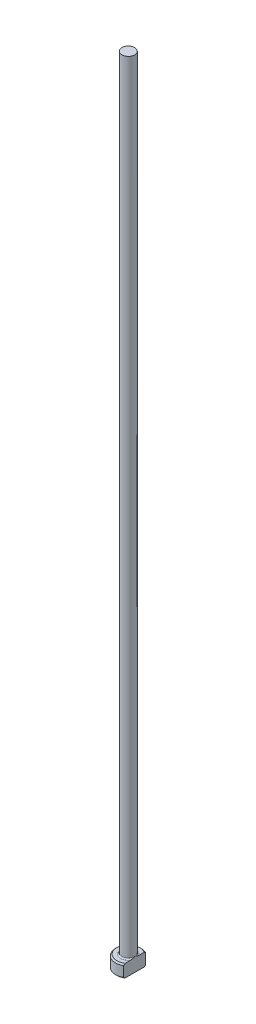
ISO-10303-21;
HEADER;
FILE_DESCRIPTION(('STEP AP214'),'2;1');
FILE_NAME('part.step','',(''),(''),'','','');
FILE_SCHEMA(('AUTOMOTIVE_DESIGN { 1 0 10303 214 1 1 1 1 }'));
ENDSEC;
DATA;
#1=APPLICATION_CONTEXT('core data for automotive mechanical design processes');
#2=APPLICATION_PROTOCOL_DEFINITION('international standard','automotive_design',2000,#1);
#3=PRODUCT_CONTEXT('',#1,'mechanical');
#4=PRODUCT('Part','Part','',(#3));
#5=PRODUCT_RELATED_PRODUCT_CATEGORY('part','',(#4));
#6=PRODUCT_DEFINITION_FORMATION('','',#4);
#7=PRODUCT_DEFINITION_CONTEXT('part definition',#1,'design');
#8=PRODUCT_DEFINITION('design','',#6,#7);
#9=PRODUCT_DEFINITION_SHAPE('','',#8);
#10=(LENGTH_UNIT() NAMED_UNIT(*) SI_UNIT(.MILLI.,.METRE.));
#11=(NAMED_UNIT(*) PLANE_ANGLE_UNIT() SI_UNIT($,.RADIAN.));
#12=(NAMED_UNIT(*) SI_UNIT($,.STERADIAN.) SOLID_ANGLE_UNIT());
#13=UNCERTAINTY_MEASURE_WITH_UNIT(LENGTH_MEASURE(1.E-05),#10,'distance_accuracy_value','');
#14=(GEOMETRIC_REPRESENTATION_CONTEXT(3) GLOBAL_UNCERTAINTY_ASSIGNED_CONTEXT((#13)) GLOBAL_UNIT_ASSIGNED_CONTEXT((#10,
#11,#12)) REPRESENTATION_CONTEXT('',''));
#15=CARTESIAN_POINT('',(0.,0.,0.));
#16=DIRECTION('',(0.,0.,1.));
#17=DIRECTION('',(1.,0.,0.));
#18=AXIS2_PLACEMENT_3D('',#15,#16,#17);
#19=CARTESIAN_POINT('',(0.,0.,0.));
#20=DIRECTION('',(0.,-1.,0.));
#21=DIRECTION('',(0.,0.,-1.));
#22=AXIS2_PLACEMENT_3D('',#19,#20,#21);
#23=PLANE('',#22);
#24=CARTESIAN_POINT('',(0.,0.,0.));
#25=DIRECTION('',(0.,-1.,0.));
#26=DIRECTION('',(0.,0.,-1.));
#27=AXIS2_PLACEMENT_3D('',#24,#25,#26);
#28=CIRCLE('',#27,1.8);
#29=CARTESIAN_POINT('',(0.999999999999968,0.,1.49666295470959));
#30=VERTEX_POINT('',#29);
#31=CARTESIAN_POINT('',(0.999999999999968,0.,-1.49666295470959));
#32=VERTEX_POINT('',#31);
#33=EDGE_CURVE('E98',#30,#32,#28,.T.);
#34=ORIENTED_EDGE('',*,*,#33,.T.);
#35=DIRECTION('',(0.,0.,1.));
#36=VECTOR('',#35,1.);
#37=CARTESIAN_POINT('',(0.999999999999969,0.,-1.73205080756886));
#38=LINE('',#37,#36);
#39=EDGE_CURVE('E83',#32,#30,#38,.T.);
#40=ORIENTED_EDGE('',*,*,#39,.T.);
#41=EDGE_LOOP('',(#34,#40));
#42=FACE_BOUND('',#41,.T.);
#43=ADVANCED_FACE('F32',(#42),#23,.T.);
#44=CARTESIAN_POINT('',(0.,259.958771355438,0.));
#45=DIRECTION('',(0.,1.,0.));
#46=DIRECTION('',(0.,0.,1.));
#47=AXIS2_PLACEMENT_3D('',#44,#45,#46);
#48=CYLINDRICAL_SURFACE('',#47,1.99999999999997);
#49=CARTESIAN_POINT('',(0.,1.79999999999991,0.));
#50=DIRECTION('',(0.,1.,0.));
#51=DIRECTION('',(0.,0.,1.));
#52=AXIS2_PLACEMENT_3D('',#49,#50,#51);
#53=CIRCLE('',#52,1.99999999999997);
#54=CARTESIAN_POINT('',(0.999999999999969,1.79999999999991,1.73205080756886));
#55=VERTEX_POINT('',#54);
#56=CARTESIAN_POINT('',(0.999999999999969,1.79999999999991,-1.73205080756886));
#57=VERTEX_POINT('',#56);
#58=EDGE_CURVE('E104',#55,#57,#53,.F.);
#59=ORIENTED_EDGE('',*,*,#58,.T.);
#60=DIRECTION('',(0.,-1.,0.));
#61=VECTOR('',#60,1.);
#62=CARTESIAN_POINT('',(0.999999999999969,125.,-1.73205080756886));
#63=LINE('',#62,#61);
#64=CARTESIAN_POINT('',(0.999999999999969,0.199999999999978,-1.73205080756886));
#65=VERTEX_POINT('',#64);
#66=EDGE_CURVE('E183',#57,#65,#63,.T.);
#67=ORIENTED_EDGE('',*,*,#66,.T.);
#68=CARTESIAN_POINT('',(0.,0.199999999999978,0.));
#69=DIRECTION('',(0.,-1.,0.));
#70=DIRECTION('',(0.,0.,-1.));
#71=AXIS2_PLACEMENT_3D('',#68,#69,#70);
#72=CIRCLE('',#71,1.99999999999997);
#73=CARTESIAN_POINT('',(0.999999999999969,0.199999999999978,1.73205080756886));
#74=VERTEX_POINT('',#73);
#75=EDGE_CURVE('E100',#65,#74,#72,.F.);
#76=ORIENTED_EDGE('',*,*,#75,.T.);
#77=DIRECTION('',(0.,-1.,0.));
#78=VECTOR('',#77,1.);
#79=CARTESIAN_POINT('',(0.999999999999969,125.,1.73205080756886));
#80=LINE('',#79,#78);
#81=EDGE_CURVE('E93',#55,#74,#80,.T.);
#82=ORIENTED_EDGE('',*,*,#81,.F.);
#83=EDGE_LOOP('',(#59,#67,#76,#82));
#84=FACE_BOUND('',#83,.T.);
#85=ADVANCED_FACE('F158',(#84),#48,.T.);
#86=CARTESIAN_POINT('',(-1.99999999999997,2.,0.));
#87=DIRECTION('',(0.,1.,0.));
#88=DIRECTION('',(0.,0.,1.));
#89=AXIS2_PLACEMENT_3D('',#86,#87,#88);
#90=PLANE('',#89);
#91=CARTESIAN_POINT('',(0.,2.,0.));
#92=DIRECTION('',(0.,1.,0.));
#93=DIRECTION('',(0.,0.,1.));
#94=AXIS2_PLACEMENT_3D('',#91,#92,#93);
#95=CIRCLE('',#94,1.79999999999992);
#96=CARTESIAN_POINT('',(0.999999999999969,2.,-1.49666295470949));
#97=VERTEX_POINT('',#96);
#98=CARTESIAN_POINT('',(0.999999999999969,2.,1.49666295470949));
#99=VERTEX_POINT('',#98);
#100=EDGE_CURVE('E178',#97,#99,#95,.T.);
#101=ORIENTED_EDGE('',*,*,#100,.T.);
#102=DIRECTION('',(0.,0.,-1.));
#103=VECTOR('',#102,1.);
#104=CARTESIAN_POINT('',(0.999999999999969,2.,0.));
#105=LINE('',#104,#103);
#106=CARTESIAN_POINT('',(0.999999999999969,1.99999999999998,0.66332495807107));
#107=VERTEX_POINT('',#106);
#108=EDGE_CURVE('E57',#99,#107,#105,.T.);
#109=ORIENTED_EDGE('',*,*,#108,.T.);
#110=CARTESIAN_POINT('',(0.,2.,0.));
#111=DIRECTION('',(0.,1.,0.));
#112=DIRECTION('',(0.,0.,1.));
#113=AXIS2_PLACEMENT_3D('',#110,#111,#112);
#114=CIRCLE('',#113,1.19999999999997);
#115=CARTESIAN_POINT('',(0.999999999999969,1.99999999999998,-0.663324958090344));
#116=VERTEX_POINT('',#115);
#117=EDGE_CURVE('E107',#107,#116,#114,.F.);
#118=ORIENTED_EDGE('',*,*,#117,.T.);
#119=EDGE_CURVE('E136',#116,#97,#105,.T.);
#120=ORIENTED_EDGE('',*,*,#119,.T.);
#121=EDGE_LOOP('',(#101,#109,#118,#120));
#122=FACE_BOUND('',#121,.T.);
#123=ADVANCED_FACE('F147',(#122),#90,.T.);
#124=CARTESIAN_POINT('',(0.,2.,0.));
#125=DIRECTION('',(0.,-1.,0.));
#126=DIRECTION('',(0.,0.,-1.));
#127=AXIS2_PLACEMENT_3D('',#124,#125,#126);
#128=CONICAL_SURFACE('',#127,1.79999999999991,0.785398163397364);
#129=ORIENTED_EDGE('',*,*,#58,.F.);
#130=CARTESIAN_POINT('',(0.999999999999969,-0.143084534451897,3.81417299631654));
#131=CARTESIAN_POINT('',(0.999999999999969,-0.0593997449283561,3.72765647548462));
#132=CARTESIAN_POINT('',(0.999999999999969,0.0241940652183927,3.64105173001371));
#133=CARTESIAN_POINT('',(0.999999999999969,0.191148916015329,3.46761616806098));
#134=CARTESIAN_POINT('',(0.999999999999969,0.27450995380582,3.38078534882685));
#135=CARTESIAN_POINT('',(0.999999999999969,0.524249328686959,3.11979400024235));
#136=CARTESIAN_POINT('',(0.999999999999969,0.690198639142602,2.94522254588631));
#137=CARTESIAN_POINT('',(0.999999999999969,1.0169755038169,2.59782670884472));
#138=CARTESIAN_POINT('',(0.999999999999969,1.1778392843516,2.42503661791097));
#139=CARTESIAN_POINT('',(0.999999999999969,1.41669118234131,2.16364984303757));
#140=CARTESIAN_POINT('',(0.999999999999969,1.49589273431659,2.07616357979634));
#141=CARTESIAN_POINT('',(0.999999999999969,1.653138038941,1.90015721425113));
#142=CARTESIAN_POINT('',(0.999999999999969,1.73118183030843,1.81163714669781));
#143=CARTESIAN_POINT('',(0.999999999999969,1.85567318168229,1.66767927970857));
#144=CARTESIAN_POINT('',(0.999999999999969,1.90265415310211,1.61270332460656));
#145=CARTESIAN_POINT('',(0.999999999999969,1.99577882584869,1.50203557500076));
#146=CARTESIAN_POINT('',(0.999999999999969,2.0419224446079,1.44634371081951));
#147=CARTESIAN_POINT('',(0.999999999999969,2.13356596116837,1.33345480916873));
#148=CARTESIAN_POINT('',(0.999999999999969,2.17905399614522,1.27624810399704));
#149=CARTESIAN_POINT('',(0.999999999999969,2.26844283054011,1.1606097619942));
#150=CARTESIAN_POINT('',(0.999999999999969,2.31234379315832,1.1021782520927));
#151=CARTESIAN_POINT('',(0.999999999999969,2.39853453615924,0.982773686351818));
#152=CARTESIAN_POINT('',(0.999999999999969,2.4407898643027,0.921775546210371));
#153=CARTESIAN_POINT('',(0.999999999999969,2.5218781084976,0.797387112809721));
#154=CARTESIAN_POINT('',(0.999999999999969,2.56070631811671,0.733993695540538));
#155=CARTESIAN_POINT('',(0.999999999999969,2.63248592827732,0.604932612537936));
#156=CARTESIAN_POINT('',(0.999999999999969,2.66550424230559,0.539302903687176));
#157=CARTESIAN_POINT('',(0.999999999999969,2.72301550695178,0.404437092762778));
#158=CARTESIAN_POINT('',(0.999999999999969,2.74753707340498,0.335214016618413));
#159=CARTESIAN_POINT('',(0.999999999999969,2.77407110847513,0.231400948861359));
#160=CARTESIAN_POINT('',(0.999999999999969,2.78110742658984,0.198093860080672));
#161=CARTESIAN_POINT('',(0.999999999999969,2.79200506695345,0.130954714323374));
#162=CARTESIAN_POINT('',(0.999999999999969,2.79586666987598,0.0971227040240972));
#163=CARTESIAN_POINT('',(0.999999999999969,2.80013905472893,0.0293410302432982));
#164=CARTESIAN_POINT('',(0.999999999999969,2.80056046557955,-0.00460794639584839));
#165=CARTESIAN_POINT('',(0.999999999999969,2.79795882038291,-0.0723663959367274));
#166=CARTESIAN_POINT('',(0.999999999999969,2.79493547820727,-0.106175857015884));
#167=CARTESIAN_POINT('',(0.999999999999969,2.78105481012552,-0.206326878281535));
#168=CARTESIAN_POINT('',(0.999999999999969,2.76542146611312,-0.272037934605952));
#169=CARTESIAN_POINT('',(0.999999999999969,2.73477554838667,-0.368312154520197));
#170=CARTESIAN_POINT('',(0.999999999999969,2.72331063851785,-0.400123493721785));
#171=CARTESIAN_POINT('',(0.999999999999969,2.69840546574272,-0.462964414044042));
#172=CARTESIAN_POINT('',(0.999999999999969,2.68496560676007,-0.493994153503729));
#173=CARTESIAN_POINT('',(0.999999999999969,2.64209309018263,-0.586298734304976));
#174=CARTESIAN_POINT('',(0.999999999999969,2.61022871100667,-0.64643570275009));
#175=CARTESIAN_POINT('',(0.999999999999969,2.54228534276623,-0.76430433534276));
#176=CARTESIAN_POINT('',(0.999999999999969,2.50620119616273,-0.822032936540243));
#177=CARTESIAN_POINT('',(0.999999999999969,2.43107084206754,-0.935840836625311));
#178=CARTESIAN_POINT('',(0.999999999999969,2.39201347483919,-0.991912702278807));
#179=CARTESIAN_POINT('',(0.999999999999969,2.31195870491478,-1.1025984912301));
#180=CARTESIAN_POINT('',(0.999999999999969,2.27096226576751,-1.15721311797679));
#181=CARTESIAN_POINT('',(0.999999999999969,2.18701695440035,-1.26606869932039));
#182=CARTESIAN_POINT('',(0.999999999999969,2.14404946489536,-1.32029522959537));
#183=CARTESIAN_POINT('',(0.999999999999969,2.05705050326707,-1.42788988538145));
#184=CARTESIAN_POINT('',(0.999999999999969,2.01301896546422,-1.48125795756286));
#185=CARTESIAN_POINT('',(0.999999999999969,1.8799506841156,-1.64010952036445));
#186=CARTESIAN_POINT('',(0.999999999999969,1.78973357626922,-1.74460261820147));
#187=CARTESIAN_POINT('',(0.999999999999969,1.62290341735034,-1.9342683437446));
#188=CARTESIAN_POINT('',(0.999999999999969,1.54658658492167,-2.01970404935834));
#189=CARTESIAN_POINT('',(0.999999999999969,1.39301250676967,-2.18973019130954));
#190=CARTESIAN_POINT('',(0.999999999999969,1.31575523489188,-2.27432060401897));
#191=CARTESIAN_POINT('',(0.999999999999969,1.08283440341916,-2.52732479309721));
#192=CARTESIAN_POINT('',(0.999999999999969,0.926165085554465,-2.69481086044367));
#193=CARTESIAN_POINT('',(0.999999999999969,0.61777298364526,-3.0214725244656));
#194=CARTESIAN_POINT('',(0.999999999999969,0.466111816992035,-3.18070657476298));
#195=CARTESIAN_POINT('',(0.999999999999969,0.238015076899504,-3.41880818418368));
#196=CARTESIAN_POINT('',(0.999999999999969,0.161924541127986,-3.49800657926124));
#197=CARTESIAN_POINT('',(0.999999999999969,0.00955322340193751,-3.65621892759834));
#198=CARTESIAN_POINT('',(0.999999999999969,-0.0667275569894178,-3.73523288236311));
#199=CARTESIAN_POINT('',(0.999999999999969,-0.143084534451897,-3.81417299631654));
#200=B_SPLINE_CURVE_WITH_KNOTS('',3,(#130,#131,#132,#133,#134,#135,#136,#137,#138,#139,#140,
#141,#142,#143,#144,#145,#146,#147,#148,#149,#150,#151,#152,#153,#154,#155,#156,#157,#158,#159,
#160,#161,#162,#163,#164,#165,#166,#167,#168,#169,#170,#171,#172,#173,#174,#175,#176,#177,#178,
#179,#180,#181,#182,#183,#184,#185,#186,#187,#188,#189,#190,#191,#192,#193,#194,#195,#196,#197,
#198,#199),.UNSPECIFIED.,.F.,.F.,(4,2,2,2,2,2,2,2,2,2,2,2,2,2,2,2,2,2,2,2,2,2,2,2,2,2,2,2,2,2,2,
2,2,2,4),(0.,0.361101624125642,0.722207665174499,1.44478731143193,2.15299784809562,
2.50702638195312,2.86104304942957,3.07798416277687,3.29494655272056,3.51418925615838,
3.73340935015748,3.95594813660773,4.17878792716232,4.3988639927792,4.6181915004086,
4.72018864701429,4.82217677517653,4.92384967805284,5.02553102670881,5.22698459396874,
5.3283885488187,5.4297717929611,5.63365200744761,5.83778406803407,6.04272417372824,
6.24756349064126,6.45510395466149,6.66265726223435,7.07676259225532,7.42043039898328,
7.76410778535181,8.45210822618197,9.11180822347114,9.44129145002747,9.77077197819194),.UNSPECIFIED.);
#201=EDGE_CURVE('E135',#55,#99,#200,.T.);
#202=ORIENTED_EDGE('',*,*,#201,.T.);
#203=ORIENTED_EDGE('',*,*,#100,.F.);
#204=EDGE_CURVE('E127',#97,#57,#200,.T.);
#205=ORIENTED_EDGE('',*,*,#204,.T.);
#206=EDGE_LOOP('',(#129,#202,#203,#205));
#207=FACE_BOUND('',#206,.T.);
#208=ADVANCED_FACE('F143',(#207),#128,.T.);
#209=CARTESIAN_POINT('',(0.,0.199999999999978,0.));
#210=DIRECTION('',(0.,1.,0.));
#211=DIRECTION('',(0.,0.,1.));
#212=AXIS2_PLACEMENT_3D('',#209,#210,#211);
#213=CONICAL_SURFACE('',#212,1.99999999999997,0.785398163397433);
#214=ORIENTED_EDGE('',*,*,#75,.F.);
#215=CARTESIAN_POINT('',(0.999999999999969,2.14308453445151,-3.81417299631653));
#216=CARTESIAN_POINT('',(0.999999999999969,2.05939974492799,-3.72765647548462));
#217=CARTESIAN_POINT('',(0.999999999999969,1.97580593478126,-3.64105173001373));
#218=CARTESIAN_POINT('',(0.999999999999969,1.80885108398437,-3.46761616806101));
#219=CARTESIAN_POINT('',(0.999999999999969,1.7254900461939,-3.38078534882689));
#220=CARTESIAN_POINT('',(0.999999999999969,1.47575067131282,-3.11979400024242));
#221=CARTESIAN_POINT('',(0.999999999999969,1.30980136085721,-2.94522254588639));
#222=CARTESIAN_POINT('',(0.999999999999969,0.983024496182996,-2.59782670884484));
#223=CARTESIAN_POINT('',(0.999999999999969,0.822160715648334,-2.42503661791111));
#224=CARTESIAN_POINT('',(0.999999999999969,0.583308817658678,-2.16364984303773));
#225=CARTESIAN_POINT('',(0.999999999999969,0.504107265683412,-2.07616357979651));
#226=CARTESIAN_POINT('',(0.999999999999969,0.346861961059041,-1.90015721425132));
#227=CARTESIAN_POINT('',(0.999999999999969,0.268818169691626,-1.81163714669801));
#228=CARTESIAN_POINT('',(0.999999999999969,0.144326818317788,-1.66767927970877));
#229=CARTESIAN_POINT('',(0.999999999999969,0.0973458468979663,-1.61270332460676));
#230=CARTESIAN_POINT('',(0.999999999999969,0.00422117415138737,-1.50203557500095));
#231=CARTESIAN_POINT('',(0.999999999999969,-0.0419224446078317,-1.44634371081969));
#232=CARTESIAN_POINT('',(0.999999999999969,-0.133565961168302,-1.3334548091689));
#233=CARTESIAN_POINT('',(0.999999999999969,-0.179053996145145,-1.2762481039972));
#234=CARTESIAN_POINT('',(0.999999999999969,-0.268442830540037,-1.16060976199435));
#235=CARTESIAN_POINT('',(0.999999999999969,-0.31234379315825,-1.10217825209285));
#236=CARTESIAN_POINT('',(0.999999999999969,-0.398534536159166,-0.982773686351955));
#237=CARTESIAN_POINT('',(0.999999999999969,-0.440789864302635,-0.921775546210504));
#238=CARTESIAN_POINT('',(0.999999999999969,-0.521878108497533,-0.797387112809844));
#239=CARTESIAN_POINT('',(0.999999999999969,-0.560706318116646,-0.733993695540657));
#240=CARTESIAN_POINT('',(0.999999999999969,-0.632485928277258,-0.604932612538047));
#241=CARTESIAN_POINT('',(0.999999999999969,-0.665504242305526,-0.539302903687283));
#242=CARTESIAN_POINT('',(0.999999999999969,-0.723015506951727,-0.404437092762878));
#243=CARTESIAN_POINT('',(0.999999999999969,-0.747537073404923,-0.33521401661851));
#244=CARTESIAN_POINT('',(0.999999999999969,-0.774071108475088,-0.231400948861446));
#245=CARTESIAN_POINT('',(0.999999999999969,-0.781107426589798,-0.198093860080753));
#246=CARTESIAN_POINT('',(0.999999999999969,-0.792005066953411,-0.130954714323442));
#247=CARTESIAN_POINT('',(0.999999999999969,-0.795866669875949,-0.0971227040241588));
#248=CARTESIAN_POINT('',(0.999999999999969,-0.8001390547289,-0.0293410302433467));
#249=CARTESIAN_POINT('',(0.999999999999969,-0.800560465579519,0.00460794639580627));
#250=CARTESIAN_POINT('',(0.999999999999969,-0.797958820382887,0.0723663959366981));
#251=CARTESIAN_POINT('',(0.999999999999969,-0.794935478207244,0.106175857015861));
#252=CARTESIAN_POINT('',(0.999999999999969,-0.78105481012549,0.206326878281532));
#253=CARTESIAN_POINT('',(0.999999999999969,-0.765421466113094,0.272037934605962));
#254=CARTESIAN_POINT('',(0.999999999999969,-0.734775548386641,0.368312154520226));
#255=CARTESIAN_POINT('',(0.999999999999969,-0.723310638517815,0.40012349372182));
#256=CARTESIAN_POINT('',(0.999999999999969,-0.698405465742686,0.46296441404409));
#257=CARTESIAN_POINT('',(0.999999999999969,-0.684965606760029,0.493994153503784));
#258=CARTESIAN_POINT('',(0.999999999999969,-0.642093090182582,0.586298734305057));
#259=CARTESIAN_POINT('',(0.999999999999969,-0.610228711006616,0.64643570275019));
#260=CARTESIAN_POINT('',(0.999999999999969,-0.542285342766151,0.764304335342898));
#261=CARTESIAN_POINT('',(0.999999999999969,-0.506201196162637,0.8220329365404));
#262=CARTESIAN_POINT('',(0.999999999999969,-0.431070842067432,0.935840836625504));
#263=CARTESIAN_POINT('',(0.999999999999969,-0.392013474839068,0.991912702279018));
#264=CARTESIAN_POINT('',(0.999999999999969,-0.311958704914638,1.10259849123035));
#265=CARTESIAN_POINT('',(0.999999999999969,-0.270962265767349,1.15721311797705));
#266=CARTESIAN_POINT('',(0.999999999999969,-0.187016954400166,1.26606869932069));
#267=CARTESIAN_POINT('',(0.999999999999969,-0.144049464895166,1.32029522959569));
#268=CARTESIAN_POINT('',(0.999999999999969,-0.0570505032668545,1.4278898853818));
#269=CARTESIAN_POINT('',(0.999999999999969,-0.013018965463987,1.48125795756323));
#270=CARTESIAN_POINT('',(0.999999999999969,0.120049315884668,1.64010952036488));
#271=CARTESIAN_POINT('',(0.999999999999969,0.210266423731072,1.74460261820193));
#272=CARTESIAN_POINT('',(0.999999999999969,0.377096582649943,1.93426834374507));
#273=CARTESIAN_POINT('',(0.999999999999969,0.453413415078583,2.01970404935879));
#274=CARTESIAN_POINT('',(0.999999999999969,0.60698749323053,2.18973019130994));
#275=CARTESIAN_POINT('',(0.999999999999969,0.684244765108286,2.27432060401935));
#276=CARTESIAN_POINT('',(0.999999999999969,0.917165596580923,2.52732479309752));
#277=CARTESIAN_POINT('',(0.999999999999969,1.07383491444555,2.69481086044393));
#278=CARTESIAN_POINT('',(0.999999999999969,1.38222701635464,3.02147252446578));
#279=CARTESIAN_POINT('',(0.999999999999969,1.53388818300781,3.18070657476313));
#280=CARTESIAN_POINT('',(0.999999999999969,1.76198492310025,3.41880818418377));
#281=CARTESIAN_POINT('',(0.999999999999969,1.83807545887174,3.49800657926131));
#282=CARTESIAN_POINT('',(0.999999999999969,1.99044677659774,3.65621892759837));
#283=CARTESIAN_POINT('',(0.999999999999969,2.06672755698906,3.73523288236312));
#284=CARTESIAN_POINT('',(0.999999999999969,2.14308453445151,3.81417299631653));
#285=B_SPLINE_CURVE_WITH_KNOTS('',3,(#215,#216,#217,#218,#219,#220,#221,#222,#223,#224,#225,
#226,#227,#228,#229,#230,#231,#232,#233,#234,#235,#236,#237,#238,#239,#240,#241,#242,#243,#244,
#245,#246,#247,#248,#249,#250,#251,#252,#253,#254,#255,#256,#257,#258,#259,#260,#261,#262,#263,
#264,#265,#266,#267,#268,#269,#270,#271,#272,#273,#274,#275,#276,#277,#278,#279,#280,#281,#282,
#283,#284),.UNSPECIFIED.,.F.,.F.,(4,2,2,2,2,2,2,2,2,2,2,2,2,2,2,2,2,2,2,2,2,2,2,2,2,2,2,2,2,2,2,
2,2,2,4),(0.,0.361101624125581,0.722207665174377,1.44478731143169,2.15299784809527,
2.5070263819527,2.8610430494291,3.07798416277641,3.29494655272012,3.51418925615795,
3.73340935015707,3.95594813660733,4.17878792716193,4.39886399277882,4.61819150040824,
4.72018864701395,4.82217677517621,4.92384967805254,5.02553102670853,5.22698459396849,
5.32838854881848,5.42977179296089,5.63365200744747,5.83778406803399,6.04272417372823,
6.24756349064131,6.45510395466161,6.66265726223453,7.07676259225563,7.42043039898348,
7.7641077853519,8.45210822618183,9.1118082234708,9.44129145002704,9.77077197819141),.UNSPECIFIED.);
#286=EDGE_CURVE('E86',#65,#32,#285,.T.);
#287=ORIENTED_EDGE('',*,*,#286,.T.);
#288=ORIENTED_EDGE('',*,*,#33,.F.);
#289=EDGE_CURVE('E89',#30,#74,#285,.T.);
#290=ORIENTED_EDGE('',*,*,#289,.T.);
#291=EDGE_LOOP('',(#214,#287,#288,#290));
#292=FACE_BOUND('',#291,.T.);
#293=ADVANCED_FACE('F97',(#292),#213,.T.);
#294=CARTESIAN_POINT('',(0.,2.19999999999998,0.));
#295=DIRECTION('',(0.,1.,0.));
#296=DIRECTION('',(0.,0.,1.));
#297=AXIS2_PLACEMENT_3D('',#294,#295,#296);
#298=TOROIDAL_SURFACE('',#297,1.19999999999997,0.2);
#299=CARTESIAN_POINT('',(0.999999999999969,2.19999999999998,0.));
#300=CARTESIAN_POINT('',(0.999999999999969,2.20000051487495,2.59077200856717E-12));
#301=CARTESIAN_POINT('',(0.999999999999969,2.20000102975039,-9.42496325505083E-08));
#302=CARTESIAN_POINT('',(0.999999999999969,2.20000202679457,-4.00799841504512E-07));
#303=CARTESIAN_POINT('',(0.999999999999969,2.20000250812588,-6.15372268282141E-07));
#304=CARTESIAN_POINT('',(0.999999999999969,2.20000346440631,-1.13351400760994E-06));
#305=CARTESIAN_POINT('',(0.999999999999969,2.20000393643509,-1.44235223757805E-06));
#306=CARTESIAN_POINT('',(0.999999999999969,2.20000483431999,-2.11388875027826E-06));
#307=CARTESIAN_POINT('',(0.999999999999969,2.20000526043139,-2.47625951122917E-06));
#308=CARTESIAN_POINT('',(0.999999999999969,2.20000666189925,-3.75794156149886E-06));
#309=CARTESIAN_POINT('',(0.999999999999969,2.20000757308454,-4.74818955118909E-06));
#310=CARTESIAN_POINT('',(0.999999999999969,2.20000922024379,-6.81289830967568E-06));
#311=CARTESIAN_POINT('',(0.999999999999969,2.20000996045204,-7.88417644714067E-06));
#312=CARTESIAN_POINT('',(0.999999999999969,2.20001267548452,-1.19907293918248E-05));
#313=CARTESIAN_POINT('',(0.999999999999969,2.20001450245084,-1.51274184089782E-05));
#314=CARTESIAN_POINT('',(0.999999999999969,2.20001755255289,-2.1371542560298E-05));
#315=CARTESIAN_POINT('',(0.999999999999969,2.20001881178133,-2.44620176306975E-05));
#316=CARTESIAN_POINT('',(0.999999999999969,2.20002404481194,-3.74145208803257E-05));
#317=CARTESIAN_POINT('',(0.999999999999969,2.20002793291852,-4.73052124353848E-05));
#318=CARTESIAN_POINT('',(0.999999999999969,2.2000342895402,-6.59457075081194E-05));
#319=CARTESIAN_POINT('',(0.999999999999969,2.2000368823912,-7.46515299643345E-05));
#320=CARTESIAN_POINT('',(0.999999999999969,2.20005709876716,-0.00013702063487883));
#321=CARTESIAN_POINT('',(0.999999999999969,2.20008244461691,-0.000187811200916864));
#322=CARTESIAN_POINT('',(0.999999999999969,2.20017671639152,-0.000384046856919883));
#323=CARTESIAN_POINT('',(0.999999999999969,2.20023990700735,-0.000531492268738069));
#324=CARTESIAN_POINT('',(0.999999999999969,2.20048701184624,-0.00109942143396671));
#325=CARTESIAN_POINT('',(0.999999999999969,2.20067693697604,-0.00151784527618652));
#326=CARTESIAN_POINT('',(0.999999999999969,2.20144296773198,-0.00321386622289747));
#327=CARTESIAN_POINT('',(0.999999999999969,2.20201230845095,-0.00449374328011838));
#328=CARTESIAN_POINT('',(0.999999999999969,2.20998444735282,-0.0224047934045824));
#329=CARTESIAN_POINT('',(0.999999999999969,2.2174352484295,-0.0390202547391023));
#330=CARTESIAN_POINT('',(0.999999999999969,2.2319700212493,-0.0717084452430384));
#331=CARTESIAN_POINT('',(0.999999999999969,2.23905766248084,-0.0877796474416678));
#332=CARTESIAN_POINT('',(0.999999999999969,2.25389009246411,-0.121781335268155));
#333=CARTESIAN_POINT('',(0.999999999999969,2.26161964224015,-0.139718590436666));
#334=CARTESIAN_POINT('',(0.999999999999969,2.27689168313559,-0.175878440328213));
#335=CARTESIAN_POINT('',(0.999999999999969,2.28443162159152,-0.194102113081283));
#336=CARTESIAN_POINT('',(0.999999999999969,2.30282726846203,-0.239840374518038));
#337=CARTESIAN_POINT('',(0.999999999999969,2.31345710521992,-0.267447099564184));
#338=CARTESIAN_POINT('',(0.999999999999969,2.33331094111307,-0.322481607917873));
#339=CARTESIAN_POINT('',(0.999999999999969,2.34256072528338,-0.349899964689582));
#340=CARTESIAN_POINT('',(0.999999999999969,2.35732089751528,-0.398044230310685));
#341=CARTESIAN_POINT('',(0.999999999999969,2.36317895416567,-0.41866173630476));
#342=CARTESIAN_POINT('',(0.999999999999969,2.37387907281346,-0.460275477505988));
#343=CARTESIAN_POINT('',(0.999999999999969,2.37871519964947,-0.481273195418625));
#344=CARTESIAN_POINT('',(0.999999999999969,2.39174175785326,-0.546853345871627));
#345=CARTESIAN_POINT('',(0.999999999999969,2.39776253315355,-0.591947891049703));
#346=CARTESIAN_POINT('',(0.999999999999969,2.40040174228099,-0.660990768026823));
#347=CARTESIAN_POINT('',(0.999999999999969,2.400126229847,-0.684818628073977));
#348=CARTESIAN_POINT('',(0.999999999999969,2.39660783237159,-0.732027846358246));
#349=CARTESIAN_POINT('',(0.999999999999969,2.39339826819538,-0.755411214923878));
#350=CARTESIAN_POINT('',(0.999999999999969,2.38447874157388,-0.796083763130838));
#351=CARTESIAN_POINT('',(0.999999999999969,2.37951676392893,-0.813533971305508));
#352=CARTESIAN_POINT('',(0.999999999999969,2.36698902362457,-0.84753143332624));
#353=CARTESIAN_POINT('',(0.999999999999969,2.35942232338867,-0.864078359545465));
#354=CARTESIAN_POINT('',(0.999999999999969,2.34431787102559,-0.89014154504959));
#355=CARTESIAN_POINT('',(0.999999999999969,2.33762931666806,-0.900148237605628));
#356=CARTESIAN_POINT('',(0.999999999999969,2.32281345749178,-0.9190336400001));
#357=CARTESIAN_POINT('',(0.999999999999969,2.3146887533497,-0.927914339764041));
#358=CARTESIAN_POINT('',(0.999999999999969,2.29878569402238,-0.942427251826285));
#359=CARTESIAN_POINT('',(0.999999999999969,2.29127620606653,-0.948352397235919));
#360=CARTESIAN_POINT('',(0.999999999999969,2.27538509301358,-0.958904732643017));
#361=CARTESIAN_POINT('',(0.999999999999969,2.26700378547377,-0.963532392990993));
#362=CARTESIAN_POINT('',(0.999999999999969,2.24944905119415,-0.971220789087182));
#363=CARTESIAN_POINT('',(0.999999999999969,2.24026913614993,-0.974266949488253));
#364=CARTESIAN_POINT('',(0.999999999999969,2.22148612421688,-0.978466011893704));
#365=CARTESIAN_POINT('',(0.999999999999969,2.21188346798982,-0.979620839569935));
#366=CARTESIAN_POINT('',(0.999999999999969,2.19406751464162,-0.979911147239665));
#367=CARTESIAN_POINT('',(0.999999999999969,2.18585759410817,-0.979318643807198));
#368=CARTESIAN_POINT('',(0.999999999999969,2.16966497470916,-0.976727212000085));
#369=CARTESIAN_POINT('',(0.999999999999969,2.16168225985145,-0.974728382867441));
#370=CARTESIAN_POINT('',(0.999999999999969,2.14632905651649,-0.969513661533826));
#371=CARTESIAN_POINT('',(0.999999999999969,2.13894889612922,-0.966325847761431));
#372=CARTESIAN_POINT('',(0.999999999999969,2.12474145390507,-0.958901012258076));
#373=CARTESIAN_POINT('',(0.999999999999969,2.11791436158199,-0.954663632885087));
#374=CARTESIAN_POINT('',(0.999999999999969,2.10210888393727,-0.943323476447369));
#375=CARTESIAN_POINT('',(0.999999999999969,2.09345388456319,-0.935769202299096));
#376=CARTESIAN_POINT('',(0.999999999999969,2.07747441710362,-0.919359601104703));
#377=CARTESIAN_POINT('',(0.999999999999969,2.07015330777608,-0.910501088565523));
#378=CARTESIAN_POINT('',(0.999999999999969,2.05394486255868,-0.887884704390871));
#379=CARTESIAN_POINT('',(0.999999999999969,2.04572469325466,-0.873650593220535));
#380=CARTESIAN_POINT('',(0.999999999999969,2.03162462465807,-0.844119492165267));
#381=CARTESIAN_POINT('',(0.999999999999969,2.02574383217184,-0.828822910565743));
#382=CARTESIAN_POINT('',(0.999999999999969,2.01314628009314,-0.78860523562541));
#383=CARTESIAN_POINT('',(0.999999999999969,2.00790637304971,-0.763225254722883));
#384=CARTESIAN_POINT('',(0.999999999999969,2.00123778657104,-0.711706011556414));
#385=CARTESIAN_POINT('',(0.999999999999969,1.99986086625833,-0.685561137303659));
#386=CARTESIAN_POINT('',(0.999999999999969,2.00029138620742,-0.610897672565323));
#387=CARTESIAN_POINT('',(0.999999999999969,2.00583944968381,-0.562408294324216));
#388=CARTESIAN_POINT('',(0.999999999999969,2.01894675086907,-0.492015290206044));
#389=CARTESIAN_POINT('',(0.999999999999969,2.02392178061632,-0.469516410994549));
#390=CARTESIAN_POINT('',(0.999999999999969,2.03507986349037,-0.424950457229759));
#391=CARTESIAN_POINT('',(0.999999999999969,2.04125559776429,-0.402881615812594));
#392=CARTESIAN_POINT('',(0.999999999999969,2.05640318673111,-0.353063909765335));
#393=CARTESIAN_POINT('',(0.999999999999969,2.06567810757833,-0.325409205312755));
#394=CARTESIAN_POINT('',(0.999999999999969,2.08561584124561,-0.269900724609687));
#395=CARTESIAN_POINT('',(0.999999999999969,2.0963053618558,-0.242056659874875));
#396=CARTESIAN_POINT('',(0.999999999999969,2.11482832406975,-0.195905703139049));
#397=CARTESIAN_POINT('',(0.999999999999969,2.12243033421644,-0.177504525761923));
#398=CARTESIAN_POINT('',(0.999999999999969,2.13783353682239,-0.140994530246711));
#399=CARTESIAN_POINT('',(0.999999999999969,2.1456321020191,-0.122884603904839));
#400=CARTESIAN_POINT('',(0.999999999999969,2.16059970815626,-0.0885577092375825));
#401=CARTESIAN_POINT('',(0.999999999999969,2.16775305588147,-0.0723337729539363));
#402=CARTESIAN_POINT('',(0.999999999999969,2.18242403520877,-0.0393353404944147));
#403=CARTESIAN_POINT('',(0.999999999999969,2.18994542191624,-0.0225624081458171));
#404=CARTESIAN_POINT('',(0.999999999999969,2.19798770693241,-0.00449370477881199));
#405=CARTESIAN_POINT('',(0.999999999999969,2.19855706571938,-0.00321379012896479));
#406=CARTESIAN_POINT('',(0.999999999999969,2.19932310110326,-0.00151776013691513));
#407=CARTESIAN_POINT('',(0.999999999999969,2.1995130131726,-0.00109936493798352));
#408=CARTESIAN_POINT('',(0.999999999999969,2.19976010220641,-0.000531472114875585));
#409=CARTESIAN_POINT('',(0.999999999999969,2.19982328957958,-0.000384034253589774));
#410=CARTESIAN_POINT('',(0.999999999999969,2.19991755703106,-0.000187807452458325));
#411=CARTESIAN_POINT('',(0.999999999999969,2.19994290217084,-0.00013701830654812));
#412=CARTESIAN_POINT('',(0.999999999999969,2.19996311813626,-7.46508463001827E-05));
#413=CARTESIAN_POINT('',(0.999999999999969,2.19996571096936,-6.59451379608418E-05));
#414=CARTESIAN_POINT('',(0.999999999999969,2.19997206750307,-4.73048898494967E-05));
#415=CARTESIAN_POINT('',(0.999999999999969,2.1999759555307,-3.74143280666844E-05));
#416=CARTESIAN_POINT('',(0.999999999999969,2.19998118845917,-2.44619706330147E-05));
#417=CARTESIAN_POINT('',(0.999999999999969,2.19998244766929,-2.13715141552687E-05));
#418=CARTESIAN_POINT('',(0.999999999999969,2.199985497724,-1.51274243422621E-05));
#419=CARTESIAN_POINT('',(0.999999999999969,2.19998732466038,-1.19907504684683E-05));
#420=CARTESIAN_POINT('',(0.999999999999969,2.1999900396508,-7.88421137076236E-06));
#421=CARTESIAN_POINT('',(0.999999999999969,2.19999077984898,-6.81293469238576E-06));
#422=CARTESIAN_POINT('',(0.999999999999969,2.19999242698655,-4.74822681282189E-06));
#423=CARTESIAN_POINT('',(0.999999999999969,2.19999333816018,-3.75797816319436E-06));
#424=CARTESIAN_POINT('',(0.999999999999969,2.19999473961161,-2.47629275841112E-06));
#425=CARTESIAN_POINT('',(0.999999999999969,2.19999516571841,-2.11392054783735E-06));
#426=CARTESIAN_POINT('',(0.999999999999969,2.1999960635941,-1.44238031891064E-06));
#427=CARTESIAN_POINT('',(0.999999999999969,2.19999653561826,-1.13353981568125E-06));
#428=CARTESIAN_POINT('',(0.999999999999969,2.19999749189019,-6.15392568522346E-07));
#429=CARTESIAN_POINT('',(0.999999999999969,2.1999979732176,-4.00816998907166E-07));
#430=CARTESIAN_POINT('',(0.999999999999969,2.19999897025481,-9.42592107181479E-08));
#431=CARTESIAN_POINT('',(0.999999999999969,2.19999948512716,-2.59076122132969E-12));
#432=CARTESIAN_POINT('',(0.999999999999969,2.19999999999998,0.));
#433=B_SPLINE_CURVE_WITH_KNOTS('',3,(#299,#300,#301,#302,#303,#304,#305,#306,#307,#308,#309,
#310,#311,#312,#313,#314,#315,#316,#317,#318,#319,#320,#321,#322,#323,#324,#325,#326,#327,#328,
#329,#330,#331,#332,#333,#334,#335,#336,#337,#338,#339,#340,#341,#342,#343,#344,#345,#346,#347,
#348,#349,#350,#351,#352,#353,#354,#355,#356,#357,#358,#359,#360,#361,#362,#363,#364,#365,#366,
#367,#368,#369,#370,#371,#372,#373,#374,#375,#376,#377,#378,#379,#380,#381,#382,#383,#384,#385,
#386,#387,#388,#389,#390,#391,#392,#393,#394,#395,#396,#397,#398,#399,#400,#401,#402,#403,#404,
#405,#406,#407,#408,#409,#410,#411,#412,#413,#414,#415,#416,#417,#418,#419,#420,#421,#422,#423,
#424,#425,#426,#427,#428,#429,#430,#431,#432),.UNSPECIFIED.,.T.,.F.,(4,2,2,2,2,2,2,2,2,2,2,2,2,
2,2,2,2,2,2,2,2,2,2,2,2,2,2,2,2,2,2,2,2,2,2,2,2,2,2,2,2,2,2,2,2,2,2,2,2,2,2,2,2,2,2,2,2,2,2,2,2,
2,2,2,2,2,4),(0.,1.54318097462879E-06,3.11656716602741E-06,4.80252030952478E-06,
6.47855574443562E-06,1.04956563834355E-05,1.43988918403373E-05,2.52504396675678E-05,
3.5251842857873E-05,6.71249460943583E-05,9.4349675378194E-05,0.0002638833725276,
0.000745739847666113,0.00212351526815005,0.00632669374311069,0.060948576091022,0.11364394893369,
0.172237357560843,0.23140101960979,0.32012930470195,0.406905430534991,0.471177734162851,
0.535813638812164,0.67161710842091,0.742973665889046,0.813529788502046,0.867802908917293,
0.922095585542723,0.958095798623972,0.994031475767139,1.02261929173,1.05119673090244,
1.08003306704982,1.10884002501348,1.13341017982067,1.15797860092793,1.18200020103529,
1.20602999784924,1.24030227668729,1.27465969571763,1.32369575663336,1.37271307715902,
1.4500242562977,1.52836647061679,1.67385288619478,1.74297459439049,1.81168748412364,
1.89915940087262,1.9886152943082,2.04834216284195,2.10749314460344,2.16068730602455,
2.21582681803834,2.2200301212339,2.22140780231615,2.2218896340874,2.22205916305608,
2.22208638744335,2.22211826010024,2.22212826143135,2.22213911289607,2.2221430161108,
2.22214703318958,2.22214870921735,2.22215039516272,2.22215196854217,2.22215351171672),.UNSPECIFIED.);
#434=CARTESIAN_POINT('',(0.999999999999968,2.19999999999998,0.));
#435=VERTEX_POINT('',#434);
#436=EDGE_CURVE('E11',#116,#435,#433,.T.);
#437=ORIENTED_EDGE('',*,*,#436,.F.);
#438=ORIENTED_EDGE('',*,*,#117,.F.);
#439=CARTESIAN_POINT('',(0.999999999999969,2.19999999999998,0.));
#440=CARTESIAN_POINT('',(0.999999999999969,2.19999948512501,-2.59076884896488E-12));
#441=CARTESIAN_POINT('',(0.999999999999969,2.19999897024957,9.42496325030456E-08));
#442=CARTESIAN_POINT('',(0.999999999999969,2.19999797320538,4.00799841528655E-07));
#443=CARTESIAN_POINT('',(0.999999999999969,2.19999749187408,6.15372268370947E-07));
#444=CARTESIAN_POINT('',(0.999999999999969,2.19999653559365,1.1335140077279E-06));
#445=CARTESIAN_POINT('',(0.999999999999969,2.19999606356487,1.44235223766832E-06));
#446=CARTESIAN_POINT('',(0.999999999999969,2.19999516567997,2.11388875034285E-06));
#447=CARTESIAN_POINT('',(0.999999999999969,2.19999473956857,2.47625951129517E-06));
#448=CARTESIAN_POINT('',(0.999999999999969,2.19999333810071,3.75794156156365E-06));
#449=CARTESIAN_POINT('',(0.999999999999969,2.19999242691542,4.74818955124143E-06));
#450=CARTESIAN_POINT('',(0.999999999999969,2.19999077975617,6.81289830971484E-06));
#451=CARTESIAN_POINT('',(0.999999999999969,2.19999003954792,7.88417644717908E-06));
#452=CARTESIAN_POINT('',(0.999999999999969,2.19998732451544,1.19907293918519E-05));
#453=CARTESIAN_POINT('',(0.999999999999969,2.19998549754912,1.51274184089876E-05));
#454=CARTESIAN_POINT('',(0.999999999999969,2.19998244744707,2.13715425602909E-05));
#455=CARTESIAN_POINT('',(0.999999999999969,2.19998118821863,2.44620176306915E-05));
#456=CARTESIAN_POINT('',(0.999999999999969,2.19997595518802,3.74145208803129E-05));
#457=CARTESIAN_POINT('',(0.999999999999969,2.19997206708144,4.7305212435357E-05));
#458=CARTESIAN_POINT('',(0.999999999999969,2.19996571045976,6.59457075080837E-05));
#459=CARTESIAN_POINT('',(0.999999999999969,2.19996311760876,7.46515299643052E-05));
#460=CARTESIAN_POINT('',(0.999999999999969,2.1999429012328,0.000137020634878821));
#461=CARTESIAN_POINT('',(0.999999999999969,2.19991755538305,0.000187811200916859));
#462=CARTESIAN_POINT('',(0.999999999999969,2.19982328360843,0.000384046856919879));
#463=CARTESIAN_POINT('',(0.999999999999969,2.19976009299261,0.000531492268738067));
#464=CARTESIAN_POINT('',(0.999999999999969,2.19951298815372,0.00109942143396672));
#465=CARTESIAN_POINT('',(0.999999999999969,2.19932306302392,0.00151784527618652));
#466=CARTESIAN_POINT('',(0.999999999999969,2.19855703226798,0.00321386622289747));
#467=CARTESIAN_POINT('',(0.999999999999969,2.19798769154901,0.00449374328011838));
#468=CARTESIAN_POINT('',(0.999999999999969,2.19001555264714,0.0224047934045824));
#469=CARTESIAN_POINT('',(0.999999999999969,2.18256475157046,0.0390202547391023));
#470=CARTESIAN_POINT('',(0.999999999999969,2.16802997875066,0.0717084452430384));
#471=CARTESIAN_POINT('',(0.999999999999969,2.16094233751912,0.0877796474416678));
#472=CARTESIAN_POINT('',(0.999999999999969,2.14610990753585,0.121781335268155));
#473=CARTESIAN_POINT('',(0.999999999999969,2.13838035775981,0.139718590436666));
#474=CARTESIAN_POINT('',(0.999999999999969,2.12310831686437,0.175878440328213));
#475=CARTESIAN_POINT('',(0.999999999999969,2.11556837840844,0.194102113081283));
#476=CARTESIAN_POINT('',(0.999999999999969,2.09717273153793,0.239840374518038));
#477=CARTESIAN_POINT('',(0.999999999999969,2.08654289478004,0.267447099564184));
#478=CARTESIAN_POINT('',(0.999999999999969,2.06668905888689,0.322481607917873));
#479=CARTESIAN_POINT('',(0.999999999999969,2.05743927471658,0.349899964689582));
#480=CARTESIAN_POINT('',(0.999999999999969,2.04267910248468,0.398044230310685));
#481=CARTESIAN_POINT('',(0.999999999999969,2.03682104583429,0.41866173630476));
#482=CARTESIAN_POINT('',(0.999999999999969,2.0261209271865,0.460275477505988));
#483=CARTESIAN_POINT('',(0.999999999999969,2.02128480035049,0.481273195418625));
#484=CARTESIAN_POINT('',(0.999999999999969,2.0082582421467,0.546853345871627));
#485=CARTESIAN_POINT('',(0.999999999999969,2.00223746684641,0.591947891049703));
#486=CARTESIAN_POINT('',(0.999999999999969,1.99959825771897,0.660990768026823));
#487=CARTESIAN_POINT('',(0.999999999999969,1.99987377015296,0.684818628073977));
#488=CARTESIAN_POINT('',(0.999999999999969,2.00339216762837,0.732027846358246));
#489=CARTESIAN_POINT('',(0.999999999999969,2.00660173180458,0.755411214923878));
#490=CARTESIAN_POINT('',(0.999999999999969,2.01552125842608,0.796083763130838));
#491=CARTESIAN_POINT('',(0.999999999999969,2.02048323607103,0.813533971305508));
#492=CARTESIAN_POINT('',(0.999999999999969,2.03301097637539,0.84753143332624));
#493=CARTESIAN_POINT('',(0.999999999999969,2.04057767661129,0.864078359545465));
#494=CARTESIAN_POINT('',(0.999999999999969,2.05568212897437,0.89014154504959));
#495=CARTESIAN_POINT('',(0.999999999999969,2.0623706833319,0.900148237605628));
#496=CARTESIAN_POINT('',(0.999999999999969,2.07718654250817,0.9190336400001));
#497=CARTESIAN_POINT('',(0.999999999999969,2.08531124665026,0.927914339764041));
#498=CARTESIAN_POINT('',(0.999999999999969,2.10121430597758,0.942427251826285));
#499=CARTESIAN_POINT('',(0.999999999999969,2.10872379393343,0.948352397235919));
#500=CARTESIAN_POINT('',(0.999999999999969,2.12461490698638,0.958904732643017));
#501=CARTESIAN_POINT('',(0.999999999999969,2.13299621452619,0.963532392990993));
#502=CARTESIAN_POINT('',(0.999999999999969,2.15055094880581,0.971220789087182));
#503=CARTESIAN_POINT('',(0.999999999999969,2.15973086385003,0.974266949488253));
#504=CARTESIAN_POINT('',(0.999999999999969,2.17851387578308,0.978466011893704));
#505=CARTESIAN_POINT('',(0.999999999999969,2.18811653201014,0.979620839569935));
#506=CARTESIAN_POINT('',(0.999999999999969,2.20593248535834,0.979911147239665));
#507=CARTESIAN_POINT('',(0.999999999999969,2.21414240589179,0.979318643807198));
#508=CARTESIAN_POINT('',(0.999999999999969,2.23033502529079,0.976727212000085));
#509=CARTESIAN_POINT('',(0.999999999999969,2.23831774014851,0.974728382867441));
#510=CARTESIAN_POINT('',(0.999999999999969,2.25367094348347,0.969513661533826));
#511=CARTESIAN_POINT('',(0.999999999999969,2.26105110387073,0.966325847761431));
#512=CARTESIAN_POINT('',(0.999999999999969,2.27525854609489,0.958901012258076));
#513=CARTESIAN_POINT('',(0.999999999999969,2.28208563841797,0.954663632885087));
#514=CARTESIAN_POINT('',(0.999999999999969,2.29789111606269,0.943323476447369));
#515=CARTESIAN_POINT('',(0.999999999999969,2.30654611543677,0.935769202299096));
#516=CARTESIAN_POINT('',(0.999999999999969,2.32252558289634,0.919359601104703));
#517=CARTESIAN_POINT('',(0.999999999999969,2.32984669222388,0.910501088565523));
#518=CARTESIAN_POINT('',(0.999999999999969,2.34605513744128,0.887884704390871));
#519=CARTESIAN_POINT('',(0.999999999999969,2.3542753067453,0.873650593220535));
#520=CARTESIAN_POINT('',(0.999999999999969,2.36837537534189,0.844119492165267));
#521=CARTESIAN_POINT('',(0.999999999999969,2.37425616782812,0.828822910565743));
#522=CARTESIAN_POINT('',(0.999999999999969,2.38685371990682,0.78860523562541));
#523=CARTESIAN_POINT('',(0.999999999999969,2.39209362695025,0.763225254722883));
#524=CARTESIAN_POINT('',(0.999999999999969,2.39876221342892,0.711706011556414));
#525=CARTESIAN_POINT('',(0.999999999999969,2.40013913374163,0.685561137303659));
#526=CARTESIAN_POINT('',(0.999999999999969,2.39970861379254,0.610897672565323));
#527=CARTESIAN_POINT('',(0.999999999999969,2.39416055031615,0.562408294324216));
#528=CARTESIAN_POINT('',(0.999999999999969,2.38105324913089,0.492015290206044));
#529=CARTESIAN_POINT('',(0.999999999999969,2.37607821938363,0.469516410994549));
#530=CARTESIAN_POINT('',(0.999999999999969,2.36492013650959,0.424950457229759));
#531=CARTESIAN_POINT('',(0.999999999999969,2.35874440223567,0.402881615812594));
#532=CARTESIAN_POINT('',(0.999999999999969,2.34359681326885,0.353063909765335));
#533=CARTESIAN_POINT('',(0.999999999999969,2.33432189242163,0.325409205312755));
#534=CARTESIAN_POINT('',(0.999999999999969,2.31438415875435,0.269900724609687));
#535=CARTESIAN_POINT('',(0.999999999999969,2.30369463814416,0.242056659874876));
#536=CARTESIAN_POINT('',(0.999999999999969,2.28517167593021,0.195905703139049));
#537=CARTESIAN_POINT('',(0.999999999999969,2.27756966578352,0.177504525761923));
#538=CARTESIAN_POINT('',(0.999999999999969,2.26216646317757,0.140994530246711));
#539=CARTESIAN_POINT('',(0.999999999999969,2.25436789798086,0.122884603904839));
#540=CARTESIAN_POINT('',(0.999999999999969,2.2394002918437,0.0885577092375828));
#541=CARTESIAN_POINT('',(0.999999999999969,2.23224694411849,0.072333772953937));
#542=CARTESIAN_POINT('',(0.999999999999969,2.21757596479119,0.0393353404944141));
#543=CARTESIAN_POINT('',(0.999999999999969,2.21005457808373,0.0225624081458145));
#544=CARTESIAN_POINT('',(0.999999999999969,2.20201229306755,0.00449370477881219));
#545=CARTESIAN_POINT('',(0.999999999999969,2.20144293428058,0.00321379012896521));
#546=CARTESIAN_POINT('',(0.999999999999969,2.2006768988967,0.00151776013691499));
#547=CARTESIAN_POINT('',(0.999999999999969,2.20048698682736,0.00109936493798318));
#548=CARTESIAN_POINT('',(0.999999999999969,2.20023989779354,0.000531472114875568));
#549=CARTESIAN_POINT('',(0.999999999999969,2.20017671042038,0.000384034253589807));
#550=CARTESIAN_POINT('',(0.999999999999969,2.2000824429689,0.000187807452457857));
#551=CARTESIAN_POINT('',(0.999999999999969,2.20005709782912,0.000137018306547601));
#552=CARTESIAN_POINT('',(0.999999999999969,2.2000368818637,7.46508463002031E-05));
#553=CARTESIAN_POINT('',(0.999999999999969,2.2000342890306,6.59451379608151E-05));
#554=CARTESIAN_POINT('',(0.999999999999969,2.20002793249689,4.73048898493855E-05));
#555=CARTESIAN_POINT('',(0.999999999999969,2.20002404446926,3.74143280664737E-05));
#556=CARTESIAN_POINT('',(0.999999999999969,2.20001881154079,2.44619706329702E-05));
#557=CARTESIAN_POINT('',(0.999999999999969,2.20001755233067,2.1371514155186E-05));
#558=CARTESIAN_POINT('',(0.999999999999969,2.20001450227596,1.51274243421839E-05));
#559=CARTESIAN_POINT('',(0.999999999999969,2.20001267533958,1.19907504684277E-05));
#560=CARTESIAN_POINT('',(0.999999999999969,2.20000996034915,7.88421137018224E-06));
#561=CARTESIAN_POINT('',(0.999999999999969,2.20000922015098,6.81293469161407E-06));
#562=CARTESIAN_POINT('',(0.999999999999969,2.20000757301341,4.74822681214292E-06));
#563=CARTESIAN_POINT('',(0.999999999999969,2.20000666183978,3.75797816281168E-06));
#564=CARTESIAN_POINT('',(0.999999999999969,2.20000526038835,2.47629275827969E-06));
#565=CARTESIAN_POINT('',(0.999999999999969,2.20000483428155,2.11392054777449E-06));
#566=CARTESIAN_POINT('',(0.999999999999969,2.20000393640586,1.44238031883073E-06));
#567=CARTESIAN_POINT('',(0.999999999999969,2.2000034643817,1.13353981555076E-06));
#568=CARTESIAN_POINT('',(0.999999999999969,2.20000250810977,6.15392568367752E-07));
#569=CARTESIAN_POINT('',(0.999999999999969,2.20000202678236,4.00816998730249E-07));
#570=CARTESIAN_POINT('',(0.999999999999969,2.20000102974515,9.4259210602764E-08));
#571=CARTESIAN_POINT('',(0.999999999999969,2.2000005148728,2.5907580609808E-12));
#572=CARTESIAN_POINT('',(0.999999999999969,2.19999999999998,0.));
#573=B_SPLINE_CURVE_WITH_KNOTS('',3,(#439,#440,#441,#442,#443,#444,#445,#446,#447,#448,#449,
#450,#451,#452,#453,#454,#455,#456,#457,#458,#459,#460,#461,#462,#463,#464,#465,#466,#467,#468,
#469,#470,#471,#472,#473,#474,#475,#476,#477,#478,#479,#480,#481,#482,#483,#484,#485,#486,#487,
#488,#489,#490,#491,#492,#493,#494,#495,#496,#497,#498,#499,#500,#501,#502,#503,#504,#505,#506,
#507,#508,#509,#510,#511,#512,#513,#514,#515,#516,#517,#518,#519,#520,#521,#522,#523,#524,#525,
#526,#527,#528,#529,#530,#531,#532,#533,#534,#535,#536,#537,#538,#539,#540,#541,#542,#543,#544,
#545,#546,#547,#548,#549,#550,#551,#552,#553,#554,#555,#556,#557,#558,#559,#560,#561,#562,#563,
#564,#565,#566,#567,#568,#569,#570,#571,#572),.UNSPECIFIED.,.T.,.F.,(4,2,2,2,2,2,2,2,2,2,2,2,2,
2,2,2,2,2,2,2,2,2,2,2,2,2,2,2,2,2,2,2,2,2,2,2,2,2,2,2,2,2,2,2,2,2,2,2,2,2,2,2,2,2,2,2,2,2,2,2,2,
2,2,2,2,2,4),(0.,1.54318097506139E-06,3.11656716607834E-06,4.80252030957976E-06,
6.47855574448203E-06,1.04956563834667E-05,1.43988918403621E-05,2.52504396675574E-05,
3.52518428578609E-05,6.7124946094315E-05,9.43496753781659E-05,0.000263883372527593,
0.000745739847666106,0.00212351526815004,0.00632669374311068,0.060948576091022,0.11364394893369,
0.172237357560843,0.23140101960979,0.32012930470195,0.406905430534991,0.471177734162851,
0.535813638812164,0.67161710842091,0.742973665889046,0.813529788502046,0.867802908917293,
0.922095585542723,0.958095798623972,0.994031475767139,1.02261929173,1.05119673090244,
1.08003306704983,1.10884002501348,1.13341017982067,1.15797860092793,1.18200020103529,
1.20602999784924,1.24030227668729,1.27465969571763,1.32369575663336,1.37271307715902,
1.4500242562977,1.52836647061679,1.67385288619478,1.74297459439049,1.81168748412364,
1.89915940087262,1.9886152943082,2.04834216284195,2.10749314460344,2.16068730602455,
2.21582681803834,2.2200301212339,2.22140780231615,2.2218896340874,2.22205916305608,
2.22208638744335,2.22211826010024,2.22212826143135,2.22213911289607,2.2221430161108,
2.22214703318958,2.22214870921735,2.22215039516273,2.22215196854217,2.22215351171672),.UNSPECIFIED.);
#574=EDGE_CURVE('E46',#435,#107,#573,.T.);
#575=ORIENTED_EDGE('',*,*,#574,.F.);
#576=CARTESIAN_POINT('',(0.,2.19999999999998,0.));
#577=DIRECTION('',(0.,1.,0.));
#578=DIRECTION('',(0.,0.,1.));
#579=AXIS2_PLACEMENT_3D('',#576,#577,#578);
#580=CIRCLE('',#579,0.999999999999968);
#581=EDGE_CURVE('E103',#435,#435,#580,.T.);
#582=ORIENTED_EDGE('',*,*,#581,.F.);
#583=EDGE_LOOP('',(#437,#438,#575,#582));
#584=FACE_BOUND('',#583,.T.);
#585=ADVANCED_FACE('F34',(#584),#298,.F.);
#586=CARTESIAN_POINT('',(0.,259.958771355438,0.));
#587=DIRECTION('',(0.,1.,0.));
#588=DIRECTION('',(0.,0.,1.));
#589=AXIS2_PLACEMENT_3D('',#586,#587,#588);
#590=CYLINDRICAL_SURFACE('',#589,0.999999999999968);
#591=ORIENTED_EDGE('',*,*,#581,.T.);
#592=EDGE_LOOP('',(#591));
#593=FACE_BOUND('',#592,.T.);
#594=CARTESIAN_POINT('',(0.,125.,0.));
#595=DIRECTION('',(0.,1.,0.));
#596=DIRECTION('',(0.,0.,1.));
#597=AXIS2_PLACEMENT_3D('',#594,#595,#596);
#598=CIRCLE('',#597,0.999999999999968);
#599=CARTESIAN_POINT('',(0.,125.,0.999999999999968));
#600=VERTEX_POINT('',#599);
#601=EDGE_CURVE('E101',#600,#600,#598,.T.);
#602=ORIENTED_EDGE('',*,*,#601,.F.);
#603=EDGE_LOOP('',(#602));
#604=FACE_BOUND('',#603,.T.);
#605=ADVANCED_FACE('F155',(#593,#604),#590,.T.);
#606=CARTESIAN_POINT('',(-0.999999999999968,125.,0.));
#607=DIRECTION('',(0.,1.,0.));
#608=DIRECTION('',(0.,0.,1.));
#609=AXIS2_PLACEMENT_3D('',#606,#607,#608);
#610=PLANE('',#609);
#611=ORIENTED_EDGE('',*,*,#601,.T.);
#612=EDGE_LOOP('',(#611));
#613=FACE_BOUND('',#612,.T.);
#614=ADVANCED_FACE('F121',(#613),#610,.T.);
#615=CARTESIAN_POINT('',(0.999999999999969,125.,-1.73205080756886));
#616=DIRECTION('',(1.,0.,0.));
#617=DIRECTION('',(0.,0.,-1.));
#618=AXIS2_PLACEMENT_3D('',#615,#616,#617);
#619=PLANE('',#618);
#620=ORIENTED_EDGE('',*,*,#66,.F.);
#621=ORIENTED_EDGE('',*,*,#204,.F.);
#622=ORIENTED_EDGE('',*,*,#119,.F.);
#623=ORIENTED_EDGE('',*,*,#436,.T.);
#624=ORIENTED_EDGE('',*,*,#574,.T.);
#625=ORIENTED_EDGE('',*,*,#108,.F.);
#626=ORIENTED_EDGE('',*,*,#201,.F.);
#627=ORIENTED_EDGE('',*,*,#81,.T.);
#628=ORIENTED_EDGE('',*,*,#289,.F.);
#629=ORIENTED_EDGE('',*,*,#39,.F.);
#630=ORIENTED_EDGE('',*,*,#286,.F.);
#631=EDGE_LOOP('',(#620,#621,#622,#623,#624,#625,#626,#627,#628,#629,#630));
#632=FACE_BOUND('',#631,.T.);
#633=ADVANCED_FACE('F85',(#632),#619,.T.);
#634=CLOSED_SHELL('',(#43,#85,#123,#208,#293,#585,#605,#614,#633));
#635=MANIFOLD_SOLID_BREP('B2',#634);
#636=ADVANCED_BREP_SHAPE_REPRESENTATION('',(#18,#635),#14);
#637=SHAPE_DEFINITION_REPRESENTATION(#9,#636);
ENDSEC;
END-ISO-10303-21;
